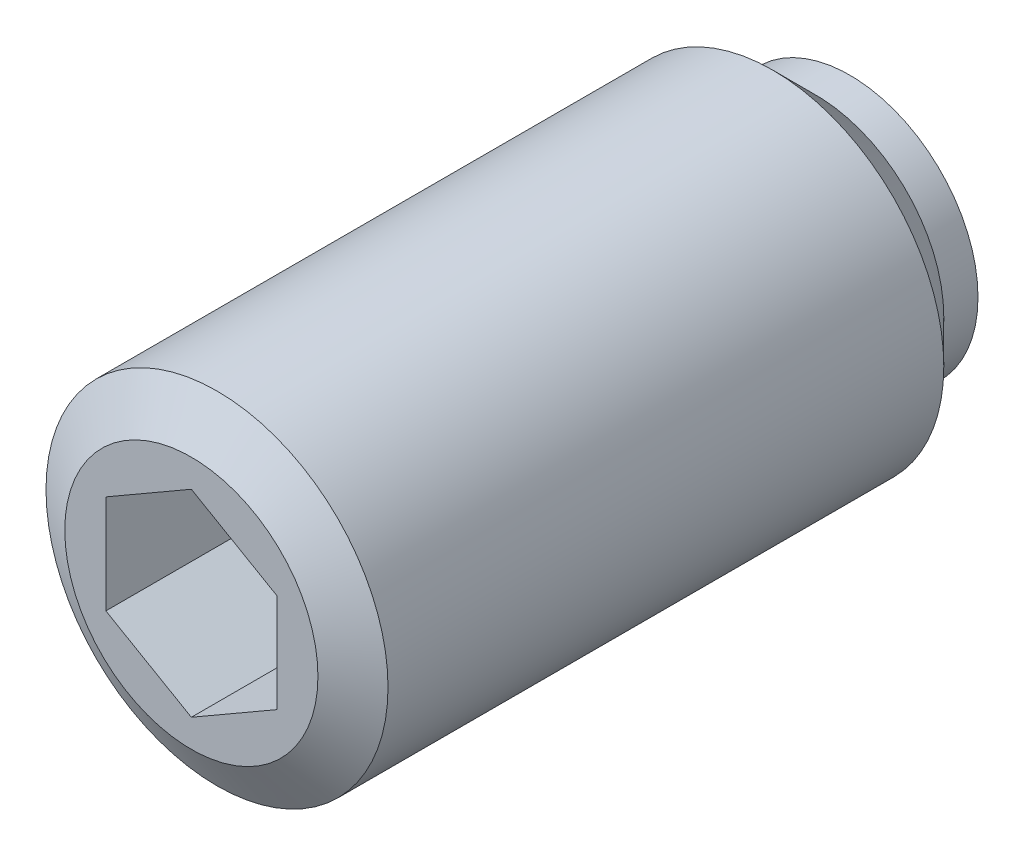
ISO-10303-21;
HEADER;
FILE_DESCRIPTION(('STEP AP214'),'2;1');
FILE_NAME('part.step','',(''),(''),'','','');
FILE_SCHEMA(('AUTOMOTIVE_DESIGN { 1 0 10303 214 1 1 1 1 }'));
ENDSEC;
DATA;
#1=APPLICATION_CONTEXT('core data for automotive mechanical design processes');
#2=APPLICATION_PROTOCOL_DEFINITION('international standard','automotive_design',2000,#1);
#3=PRODUCT_CONTEXT('',#1,'mechanical');
#4=PRODUCT('Part','Part','',(#3));
#5=PRODUCT_RELATED_PRODUCT_CATEGORY('part','',(#4));
#6=PRODUCT_DEFINITION_FORMATION('','',#4);
#7=PRODUCT_DEFINITION_CONTEXT('part definition',#1,'design');
#8=PRODUCT_DEFINITION('design','',#6,#7);
#9=PRODUCT_DEFINITION_SHAPE('','',#8);
#10=(LENGTH_UNIT() NAMED_UNIT(*) SI_UNIT(.MILLI.,.METRE.));
#11=(NAMED_UNIT(*) PLANE_ANGLE_UNIT() SI_UNIT($,.RADIAN.));
#12=(NAMED_UNIT(*) SI_UNIT($,.STERADIAN.) SOLID_ANGLE_UNIT());
#13=UNCERTAINTY_MEASURE_WITH_UNIT(LENGTH_MEASURE(1.E-05),#10,'distance_accuracy_value','');
#14=(GEOMETRIC_REPRESENTATION_CONTEXT(3) GLOBAL_UNCERTAINTY_ASSIGNED_CONTEXT((#13)) GLOBAL_UNIT_ASSIGNED_CONTEXT((#10,
#11,#12)) REPRESENTATION_CONTEXT('',''));
#15=CARTESIAN_POINT('',(0.,0.,0.));
#16=DIRECTION('',(0.,0.,1.));
#17=DIRECTION('',(1.,0.,0.));
#18=AXIS2_PLACEMENT_3D('',#15,#16,#17);
#19=CARTESIAN_POINT('',(0.,0.940733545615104,0.));
#20=DIRECTION('',(0.,0.,1.));
#21=DIRECTION('',(-1.,0.,0.));
#22=AXIS2_PLACEMENT_3D('',#19,#20,#21);
#23=PLANE('',#22);
#24=CARTESIAN_POINT('',(0.,0.,0.));
#25=DIRECTION('',(0.,0.,1.));
#26=DIRECTION('',(-1.,0.,0.));
#27=AXIS2_PLACEMENT_3D('',#24,#25,#26);
#28=CIRCLE('',#27,0.940733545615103);
#29=CARTESIAN_POINT('',(0.,0.940733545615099,0.));
#30=VERTEX_POINT('',#29);
#31=EDGE_CURVE('E9',#30,#30,#28,.T.);
#32=ORIENTED_EDGE('',*,*,#31,.F.);
#33=EDGE_LOOP('',(#32));
#34=FACE_BOUND('',#33,.T.);
#35=ADVANCED_FACE('F14',(#34),#23,.F.);
#36=CARTESIAN_POINT('',(0.,0.,0.823116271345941));
#37=DIRECTION('',(0.,0.,1.));
#38=DIRECTION('',(0.,1.,0.));
#39=AXIS2_PLACEMENT_3D('',#36,#37,#38);
#40=SPHERICAL_SURFACE('',#39,1.25);
#41=CARTESIAN_POINT('',(0.,0.,0.2));
#42=DIRECTION('',(0.,0.,1.));
#43=DIRECTION('',(-1.,0.,0.));
#44=AXIS2_PLACEMENT_3D('',#41,#42,#43);
#45=CIRCLE('',#44,1.0836171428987);
#46=CARTESIAN_POINT('',(0.,1.0836171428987,0.2));
#47=VERTEX_POINT('',#46);
#48=EDGE_CURVE('E21',#47,#47,#45,.T.);
#49=CARTESIAN_POINT('',(0.,1.0836171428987,0.2));
#50=CARTESIAN_POINT('',(0.,1.08233874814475,0.197776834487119));
#51=CARTESIAN_POINT('',(0.,1.08105351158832,0.1955576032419));
#52=CARTESIAN_POINT('',(0.,1.0784694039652,0.191127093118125));
#53=CARTESIAN_POINT('',(0.,1.0771705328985,0.188915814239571));
#54=CARTESIAN_POINT('',(0.,1.07455920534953,0.184501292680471));
#55=CARTESIAN_POINT('',(0.,1.07324674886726,0.182298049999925));
#56=CARTESIAN_POINT('',(0.,1.07060830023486,0.177899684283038));
#57=CARTESIAN_POINT('',(0.,1.06928230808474,0.175704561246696));
#58=CARTESIAN_POINT('',(0.,1.06661683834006,0.171322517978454));
#59=CARTESIAN_POINT('',(0.,1.0652773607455,0.169135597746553));
#60=CARTESIAN_POINT('',(0.,1.06258497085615,0.164770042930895));
#61=CARTESIAN_POINT('',(0.,1.06123205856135,0.162591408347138));
#62=CARTESIAN_POINT('',(0.,1.05851285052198,0.158242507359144));
#63=CARTESIAN_POINT('',(0.,1.05714655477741,0.156072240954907));
#64=CARTESIAN_POINT('',(0.,1.05440063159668,0.151740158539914));
#65=CARTESIAN_POINT('',(0.,1.05302100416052,0.149578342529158));
#66=CARTESIAN_POINT('',(0.,1.05024846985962,0.145263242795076));
#67=CARTESIAN_POINT('',(0.,1.04885556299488,0.143109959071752));
#68=CARTESIAN_POINT('',(0.,1.04605652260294,0.138812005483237));
#69=CARTESIAN_POINT('',(0.,1.04465038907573,0.136667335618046));
#70=CARTESIAN_POINT('',(0.,1.04182494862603,0.132386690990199));
#71=CARTESIAN_POINT('',(0.,1.04040564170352,0.130250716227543));
#72=CARTESIAN_POINT('',(0.,1.0375539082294,0.125987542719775));
#73=CARTESIAN_POINT('',(0.,1.03612148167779,0.123860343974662));
#74=CARTESIAN_POINT('',(0.,1.03324356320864,0.119614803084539));
#75=CARTESIAN_POINT('',(0.,1.03179807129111,0.117496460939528));
#76=CARTESIAN_POINT('',(0.,1.02889407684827,0.113268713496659));
#77=CARTESIAN_POINT('',(0.,1.02743557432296,0.1111593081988));
#78=CARTESIAN_POINT('',(0.,1.02450561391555,0.106949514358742));
#79=CARTESIAN_POINT('',(0.,1.02303415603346,0.104849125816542));
#80=CARTESIAN_POINT('',(0.,1.02007834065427,0.100657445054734));
#81=CARTESIAN_POINT('',(0.,1.01859398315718,0.0985661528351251));
#82=CARTESIAN_POINT('',(0.,1.01561242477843,0.094392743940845));
#83=CARTESIAN_POINT('',(0.,1.01411522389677,0.0923106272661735));
#84=CARTESIAN_POINT('',(0.,1.01110803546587,0.0881556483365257));
#85=CARTESIAN_POINT('',(0.,1.00959804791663,0.0860827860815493));
#86=CARTESIAN_POINT('',(0.,1.00656534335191,0.0819463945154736));
#87=CARTESIAN_POINT('',(0.,1.00504262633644,0.0798828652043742));
#88=CARTESIAN_POINT('',(0.,1.00198452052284,0.0757652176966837));
#89=CARTESIAN_POINT('',(0.,1.00044913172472,0.0737110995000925));
#90=CARTESIAN_POINT('',(0.,0.99736574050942,0.0696123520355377));
#91=CARTESIAN_POINT('',(0.,0.99581773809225,0.0675677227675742));
#92=CARTESIAN_POINT('',(0.,0.992709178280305,0.0634880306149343));
#93=CARTESIAN_POINT('',(0.,0.991148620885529,0.061452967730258));
#94=CARTESIAN_POINT('',(0.,0.988015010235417,0.0573924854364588));
#95=CARTESIAN_POINT('',(0.,0.986441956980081,0.055367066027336));
#96=CARTESIAN_POINT('',(0.,0.983283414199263,0.0513259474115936));
#97=CARTESIAN_POINT('',(0.,0.981697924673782,0.049310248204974));
#98=CARTESIAN_POINT('',(0.,0.978514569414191,0.0452886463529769));
#99=CARTESIAN_POINT('',(0.,0.976916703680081,0.0432827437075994));
#100=CARTESIAN_POINT('',(0.,0.973708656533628,0.0392808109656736));
#101=CARTESIAN_POINT('',(0.,0.972098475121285,0.0372847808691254));
#102=CARTESIAN_POINT('',(0.,0.968865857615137,0.0333026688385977));
#103=CARTESIAN_POINT('',(0.,0.967243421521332,0.0313165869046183));
#104=CARTESIAN_POINT('',(0.,0.963986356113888,0.0273544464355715));
#105=CARTESIAN_POINT('',(0.,0.962351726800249,0.0253783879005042));
#106=CARTESIAN_POINT('',(0.,0.959070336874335,0.0214363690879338));
#107=CARTESIAN_POINT('',(0.,0.957423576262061,0.0194704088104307));
#108=CARTESIAN_POINT('',(0.,0.954117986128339,0.0155486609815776));
#109=CARTESIAN_POINT('',(0.,0.952459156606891,0.0135928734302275));
#110=CARTESIAN_POINT('',(0.,0.949129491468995,0.00969154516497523));
#111=CARTESIAN_POINT('',(0.,0.947458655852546,0.00774600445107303));
#112=CARTESIAN_POINT('',(0.,0.944105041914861,0.00386524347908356));
#113=CARTESIAN_POINT('',(0.,0.942422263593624,0.00193002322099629));
#114=CARTESIAN_POINT('',(0.,0.940733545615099,0.));
#115=B_SPLINE_CURVE_WITH_KNOTS('',3,(#49,#50,#51,#52,#53,#54,#55,#56,#57,#58,#59,#60,#61,#62,
#63,#64,#65,#66,#67,#68,#69,#70,#71,#72,#73,#74,#75,#76,#77,#78,#79,#80,#81,#82,#83,#84,#85,#86,
#87,#88,#89,#90,#91,#92,#93,#94,#95,#96,#97,#98,#99,#100,#101,#102,#103,#104,#105,#106,#107,
#108,#109,#110,#111,#112,#113,#114),.UNSPECIFIED.,.F.,.F.,(4,2,2,2,2,2,2,2,2,2,2,2,2,2,2,2,2,2,
2,2,2,2,2,2,2,2,2,2,2,2,2,2,4),(0.,0.00769354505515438,0.0153870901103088,0.0230806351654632,
0.0307741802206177,0.0384677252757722,0.0461612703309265,0.0538548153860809,0.0615483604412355,
0.0692419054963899,0.0769354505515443,0.0846289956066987,0.092322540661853,0.100016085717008,
0.107709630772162,0.115403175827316,0.123096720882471,0.130790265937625,0.13848381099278,
0.146177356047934,0.153870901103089,0.161564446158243,0.169257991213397,0.176951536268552,
0.184645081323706,0.192338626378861,0.200032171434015,0.20772571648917,0.215419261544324,
0.223112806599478,0.230806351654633,0.238499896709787,0.246193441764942),.UNSPECIFIED.);
#116=EDGE_CURVE('BSEAM141',#47,#30,#115,.T.);
#117=ORIENTED_EDGE('',*,*,#48,.F.);
#118=ORIENTED_EDGE('',*,*,#31,.T.);
#119=ORIENTED_EDGE('',*,*,#116,.T.);
#120=ORIENTED_EDGE('',*,*,#116,.F.);
#121=EDGE_LOOP('',(#117,#119,#118,#120));
#122=FACE_BOUND('',#121,.T.);
#123=ADVANCED_FACE('F141',(#122),#40,.T.);
#124=CARTESIAN_POINT('',(0.,1.5,0.2));
#125=DIRECTION('',(0.,0.,1.));
#126=DIRECTION('',(-1.,0.,0.));
#127=AXIS2_PLACEMENT_3D('',#124,#125,#126);
#128=PLANE('',#127);
#129=CARTESIAN_POINT('',(0.,0.,0.2));
#130=DIRECTION('',(0.,0.,1.));
#131=DIRECTION('',(-1.,0.,0.));
#132=AXIS2_PLACEMENT_3D('',#129,#130,#131);
#133=CIRCLE('',#132,1.5);
#134=CARTESIAN_POINT('',(-1.5,0.,0.2));
#135=VERTEX_POINT('',#134);
#136=EDGE_CURVE('E134',#135,#135,#133,.T.);
#137=ORIENTED_EDGE('',*,*,#136,.F.);
#138=EDGE_LOOP('',(#137));
#139=FACE_BOUND('',#138,.T.);
#140=ORIENTED_EDGE('',*,*,#48,.T.);
#141=EDGE_LOOP('',(#140));
#142=FACE_BOUND('',#141,.T.);
#143=ADVANCED_FACE('F139',(#139,#142),#128,.F.);
#144=CARTESIAN_POINT('',(0.,0.,9.29507492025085));
#145=DIRECTION('',(0.,0.,1.));
#146=DIRECTION('',(-1.,0.,0.));
#147=AXIS2_PLACEMENT_3D('',#144,#145,#146);
#148=CYLINDRICAL_SURFACE('',#147,1.5);
#149=CARTESIAN_POINT('',(0.,0.,0.6));
#150=DIRECTION('',(0.,0.,1.));
#151=DIRECTION('',(-1.,0.,0.));
#152=AXIS2_PLACEMENT_3D('',#149,#150,#151);
#153=CIRCLE('',#152,1.5);
#154=CARTESIAN_POINT('',(-1.5,0.,0.6));
#155=VERTEX_POINT('',#154);
#156=EDGE_CURVE('E131',#155,#155,#153,.T.);
#157=ORIENTED_EDGE('',*,*,#156,.F.);
#158=EDGE_LOOP('',(#157));
#159=FACE_BOUND('',#158,.T.);
#160=ORIENTED_EDGE('',*,*,#136,.T.);
#161=EDGE_LOOP('',(#160));
#162=FACE_BOUND('',#161,.T.);
#163=ADVANCED_FACE('F164',(#159,#162),#148,.T.);
#164=CARTESIAN_POINT('',(0.,0.,0.6));
#165=DIRECTION('',(0.,0.,1.));
#166=DIRECTION('',(-1.,0.,0.));
#167=AXIS2_PLACEMENT_3D('',#164,#165,#166);
#168=CONICAL_SURFACE('',#167,1.5,0.785398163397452);
#169=CARTESIAN_POINT('',(0.,0.,1.1));
#170=DIRECTION('',(0.,0.,1.));
#171=DIRECTION('',(-1.,0.,0.));
#172=AXIS2_PLACEMENT_3D('',#169,#170,#171);
#173=CIRCLE('',#172,2.);
#174=CARTESIAN_POINT('',(-2.,0.,1.1));
#175=VERTEX_POINT('',#174);
#176=EDGE_CURVE('E128',#175,#175,#173,.T.);
#177=ORIENTED_EDGE('',*,*,#176,.F.);
#178=EDGE_LOOP('',(#177));
#179=FACE_BOUND('',#178,.T.);
#180=ORIENTED_EDGE('',*,*,#156,.T.);
#181=EDGE_LOOP('',(#180));
#182=FACE_BOUND('',#181,.T.);
#183=ADVANCED_FACE('F173',(#179,#182),#168,.T.);
#184=CARTESIAN_POINT('',(0.,0.,9.29507492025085));
#185=DIRECTION('',(0.,0.,1.));
#186=DIRECTION('',(-1.,0.,0.));
#187=AXIS2_PLACEMENT_3D('',#184,#185,#186);
#188=CYLINDRICAL_SURFACE('',#187,2.);
#189=CARTESIAN_POINT('',(0.,0.,7.6));
#190=DIRECTION('',(0.,0.,1.));
#191=DIRECTION('',(-1.,0.,0.));
#192=AXIS2_PLACEMENT_3D('',#189,#190,#191);
#193=CIRCLE('',#192,2.);
#194=CARTESIAN_POINT('',(-2.,0.,7.6));
#195=VERTEX_POINT('',#194);
#196=EDGE_CURVE('E125',#195,#195,#193,.T.);
#197=ORIENTED_EDGE('',*,*,#196,.F.);
#198=EDGE_LOOP('',(#197));
#199=FACE_BOUND('',#198,.T.);
#200=ORIENTED_EDGE('',*,*,#176,.T.);
#201=EDGE_LOOP('',(#200));
#202=FACE_BOUND('',#201,.T.);
#203=ADVANCED_FACE('F182',(#199,#202),#188,.T.);
#204=CARTESIAN_POINT('',(0.,0.,7.6));
#205=DIRECTION('',(0.,0.,-1.));
#206=DIRECTION('',(1.,0.,0.));
#207=AXIS2_PLACEMENT_3D('',#204,#205,#206);
#208=CONICAL_SURFACE('',#207,2.,1.04719755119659);
#209=CARTESIAN_POINT('',(0.,0.,7.9));
#210=DIRECTION('',(0.,0.,1.));
#211=DIRECTION('',(-1.,0.,0.));
#212=AXIS2_PLACEMENT_3D('',#209,#210,#211);
#213=CIRCLE('',#212,1.48038475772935);
#214=CARTESIAN_POINT('',(-1.48038475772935,0.,7.9));
#215=VERTEX_POINT('',#214);
#216=EDGE_CURVE('E116',#215,#215,#213,.T.);
#217=ORIENTED_EDGE('',*,*,#216,.F.);
#218=EDGE_LOOP('',(#217));
#219=FACE_BOUND('',#218,.T.);
#220=ORIENTED_EDGE('',*,*,#196,.T.);
#221=EDGE_LOOP('',(#220));
#222=FACE_BOUND('',#221,.T.);
#223=ADVANCED_FACE('F191',(#219,#222),#208,.T.);
#224=CARTESIAN_POINT('',(0.,0.,7.9));
#225=DIRECTION('',(0.,0.,-1.));
#226=DIRECTION('',(1.,0.,0.));
#227=AXIS2_PLACEMENT_3D('',#224,#225,#226);
#228=PLANE('',#227);
#229=DIRECTION('',(-0.866025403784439,-0.5,0.));
#230=VECTOR('',#229,1.);
#231=CARTESIAN_POINT('',(0.,1.15470053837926,7.9));
#232=LINE('',#231,#230);
#233=CARTESIAN_POINT('',(0.,1.15470053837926,7.9));
#234=VERTEX_POINT('',#233);
#235=CARTESIAN_POINT('',(-1.,0.577350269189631,7.9));
#236=VERTEX_POINT('',#235);
#237=EDGE_CURVE('E82',#234,#236,#232,.T.);
#238=ORIENTED_EDGE('',*,*,#237,.F.);
#239=DIRECTION('',(-0.866025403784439,0.5,0.));
#240=VECTOR('',#239,1.);
#241=CARTESIAN_POINT('',(1.,0.577350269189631,7.9));
#242=LINE('',#241,#240);
#243=CARTESIAN_POINT('',(1.,0.577350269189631,7.9));
#244=VERTEX_POINT('',#243);
#245=EDGE_CURVE('E28',#244,#234,#242,.T.);
#246=ORIENTED_EDGE('',*,*,#245,.F.);
#247=DIRECTION('',(0.,1.,0.));
#248=VECTOR('',#247,1.);
#249=CARTESIAN_POINT('',(1.,-0.577350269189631,7.9));
#250=LINE('',#249,#248);
#251=CARTESIAN_POINT('',(1.,-0.577350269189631,7.9));
#252=VERTEX_POINT('',#251);
#253=EDGE_CURVE('E98',#252,#244,#250,.T.);
#254=ORIENTED_EDGE('',*,*,#253,.F.);
#255=DIRECTION('',(0.866025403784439,0.5,0.));
#256=VECTOR('',#255,1.);
#257=CARTESIAN_POINT('',(0.,-1.15470053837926,7.9));
#258=LINE('',#257,#256);
#259=CARTESIAN_POINT('',(0.,-1.15470053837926,7.9));
#260=VERTEX_POINT('',#259);
#261=EDGE_CURVE('E92',#260,#252,#258,.T.);
#262=ORIENTED_EDGE('',*,*,#261,.F.);
#263=DIRECTION('',(0.866025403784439,-0.5,0.));
#264=VECTOR('',#263,1.);
#265=CARTESIAN_POINT('',(-1.,-0.577350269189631,7.9));
#266=LINE('',#265,#264);
#267=CARTESIAN_POINT('',(-1.,-0.577350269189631,7.9));
#268=VERTEX_POINT('',#267);
#269=EDGE_CURVE('E90',#268,#260,#266,.T.);
#270=ORIENTED_EDGE('',*,*,#269,.F.);
#271=DIRECTION('',(0.,-1.,0.));
#272=VECTOR('',#271,1.);
#273=CARTESIAN_POINT('',(-1.,0.577350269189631,7.9));
#274=LINE('',#273,#272);
#275=EDGE_CURVE('E71',#236,#268,#274,.T.);
#276=ORIENTED_EDGE('',*,*,#275,.F.);
#277=EDGE_LOOP('',(#238,#246,#254,#262,#270,#276));
#278=FACE_BOUND('',#277,.T.);
#279=ORIENTED_EDGE('',*,*,#216,.T.);
#280=EDGE_LOOP('',(#279));
#281=FACE_BOUND('',#280,.T.);
#282=ADVANCED_FACE('F86',(#278,#281),#228,.F.);
#283=CARTESIAN_POINT('',(1.,0.577350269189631,5.9));
#284=DIRECTION('',(0.5,0.866025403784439,0.));
#285=DIRECTION('',(0.866025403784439,-0.5,0.));
#286=AXIS2_PLACEMENT_3D('',#283,#284,#285);
#287=PLANE('',#286);
#288=ORIENTED_EDGE('',*,*,#245,.T.);
#289=DIRECTION('',(0.,0.,1.));
#290=VECTOR('',#289,1.);
#291=CARTESIAN_POINT('',(0.,1.15470053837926,5.9));
#292=LINE('',#291,#290);
#293=CARTESIAN_POINT('',(0.,1.15470053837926,5.9));
#294=VERTEX_POINT('',#293);
#295=EDGE_CURVE('E79',#294,#234,#292,.T.);
#296=ORIENTED_EDGE('',*,*,#295,.F.);
#297=DIRECTION('',(-0.866025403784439,0.5,0.));
#298=VECTOR('',#297,1.);
#299=CARTESIAN_POINT('',(1.,0.577350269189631,5.9));
#300=LINE('',#299,#298);
#301=CARTESIAN_POINT('',(1.,0.577350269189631,5.9));
#302=VERTEX_POINT('',#301);
#303=EDGE_CURVE('E100',#302,#294,#300,.T.);
#304=ORIENTED_EDGE('',*,*,#303,.F.);
#305=DIRECTION('',(0.,0.,1.));
#306=VECTOR('',#305,1.);
#307=CARTESIAN_POINT('',(1.,0.577350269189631,5.9));
#308=LINE('',#307,#306);
#309=EDGE_CURVE('E35',#302,#244,#308,.T.);
#310=ORIENTED_EDGE('',*,*,#309,.T.);
#311=EDGE_LOOP('',(#288,#296,#304,#310));
#312=FACE_BOUND('',#311,.T.);
#313=ADVANCED_FACE('F208',(#312),#287,.F.);
#314=CARTESIAN_POINT('',(1.,-0.577350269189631,5.9));
#315=DIRECTION('',(1.,0.,0.));
#316=DIRECTION('',(0.,-1.,0.));
#317=AXIS2_PLACEMENT_3D('',#314,#315,#316);
#318=PLANE('',#317);
#319=ORIENTED_EDGE('',*,*,#253,.T.);
#320=ORIENTED_EDGE('',*,*,#309,.F.);
#321=DIRECTION('',(0.,1.,0.));
#322=VECTOR('',#321,1.);
#323=CARTESIAN_POINT('',(1.,-0.577350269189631,5.9));
#324=LINE('',#323,#322);
#325=CARTESIAN_POINT('',(1.,-0.577350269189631,5.9));
#326=VERTEX_POINT('',#325);
#327=EDGE_CURVE('E112',#326,#302,#324,.T.);
#328=ORIENTED_EDGE('',*,*,#327,.F.);
#329=DIRECTION('',(0.,0.,1.));
#330=VECTOR('',#329,1.);
#331=CARTESIAN_POINT('',(1.,-0.577350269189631,5.9));
#332=LINE('',#331,#330);
#333=EDGE_CURVE('E117',#326,#252,#332,.T.);
#334=ORIENTED_EDGE('',*,*,#333,.T.);
#335=EDGE_LOOP('',(#319,#320,#328,#334));
#336=FACE_BOUND('',#335,.T.);
#337=ADVANCED_FACE('F216',(#336),#318,.F.);
#338=CARTESIAN_POINT('',(0.,-1.15470053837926,5.9));
#339=DIRECTION('',(0.5,-0.866025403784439,0.));
#340=DIRECTION('',(-0.866025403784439,-0.5,0.));
#341=AXIS2_PLACEMENT_3D('',#338,#339,#340);
#342=PLANE('',#341);
#343=ORIENTED_EDGE('',*,*,#261,.T.);
#344=ORIENTED_EDGE('',*,*,#333,.F.);
#345=DIRECTION('',(0.866025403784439,0.5,0.));
#346=VECTOR('',#345,1.);
#347=CARTESIAN_POINT('',(0.,-1.15470053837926,5.9));
#348=LINE('',#347,#346);
#349=CARTESIAN_POINT('',(0.,-1.15470053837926,5.9));
#350=VERTEX_POINT('',#349);
#351=EDGE_CURVE('E109',#350,#326,#348,.T.);
#352=ORIENTED_EDGE('',*,*,#351,.F.);
#353=DIRECTION('',(0.,0.,1.));
#354=VECTOR('',#353,1.);
#355=CARTESIAN_POINT('',(0.,-1.15470053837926,5.9));
#356=LINE('',#355,#354);
#357=EDGE_CURVE('E119',#350,#260,#356,.T.);
#358=ORIENTED_EDGE('',*,*,#357,.T.);
#359=EDGE_LOOP('',(#343,#344,#352,#358));
#360=FACE_BOUND('',#359,.T.);
#361=ADVANCED_FACE('F224',(#360),#342,.F.);
#362=CARTESIAN_POINT('',(-1.,-0.577350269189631,5.9));
#363=DIRECTION('',(-0.5,-0.866025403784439,0.));
#364=DIRECTION('',(-0.866025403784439,0.5,0.));
#365=AXIS2_PLACEMENT_3D('',#362,#363,#364);
#366=PLANE('',#365);
#367=ORIENTED_EDGE('',*,*,#269,.T.);
#368=ORIENTED_EDGE('',*,*,#357,.F.);
#369=DIRECTION('',(0.866025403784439,-0.5,0.));
#370=VECTOR('',#369,1.);
#371=CARTESIAN_POINT('',(-1.,-0.577350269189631,5.9));
#372=LINE('',#371,#370);
#373=CARTESIAN_POINT('',(-1.,-0.577350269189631,5.9));
#374=VERTEX_POINT('',#373);
#375=EDGE_CURVE('E106',#374,#350,#372,.T.);
#376=ORIENTED_EDGE('',*,*,#375,.F.);
#377=DIRECTION('',(0.,0.,1.));
#378=VECTOR('',#377,1.);
#379=CARTESIAN_POINT('',(-1.,-0.577350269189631,5.9));
#380=LINE('',#379,#378);
#381=EDGE_CURVE('E78',#374,#268,#380,.T.);
#382=ORIENTED_EDGE('',*,*,#381,.T.);
#383=EDGE_LOOP('',(#367,#368,#376,#382));
#384=FACE_BOUND('',#383,.T.);
#385=ADVANCED_FACE('F232',(#384),#366,.F.);
#386=CARTESIAN_POINT('',(-1.,0.577350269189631,5.9));
#387=DIRECTION('',(-1.,0.,0.));
#388=DIRECTION('',(0.,0.,-1.));
#389=AXIS2_PLACEMENT_3D('',#386,#387,#388);
#390=PLANE('',#389);
#391=ORIENTED_EDGE('',*,*,#275,.T.);
#392=ORIENTED_EDGE('',*,*,#381,.F.);
#393=DIRECTION('',(0.,-1.,0.));
#394=VECTOR('',#393,1.);
#395=CARTESIAN_POINT('',(-1.,0.577350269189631,5.9));
#396=LINE('',#395,#394);
#397=CARTESIAN_POINT('',(-1.,0.577350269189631,5.9));
#398=VERTEX_POINT('',#397);
#399=EDGE_CURVE('E74',#398,#374,#396,.T.);
#400=ORIENTED_EDGE('',*,*,#399,.F.);
#401=DIRECTION('',(0.,0.,1.));
#402=VECTOR('',#401,1.);
#403=CARTESIAN_POINT('',(-1.,0.577350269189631,5.9));
#404=LINE('',#403,#402);
#405=EDGE_CURVE('E67',#398,#236,#404,.T.);
#406=ORIENTED_EDGE('',*,*,#405,.T.);
#407=EDGE_LOOP('',(#391,#392,#400,#406));
#408=FACE_BOUND('',#407,.T.);
#409=ADVANCED_FACE('F69',(#408),#390,.F.);
#410=CARTESIAN_POINT('',(0.,1.15470053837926,5.9));
#411=DIRECTION('',(-0.5,0.866025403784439,0.));
#412=DIRECTION('',(0.866025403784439,0.5,0.));
#413=AXIS2_PLACEMENT_3D('',#410,#411,#412);
#414=PLANE('',#413);
#415=ORIENTED_EDGE('',*,*,#237,.T.);
#416=ORIENTED_EDGE('',*,*,#405,.F.);
#417=DIRECTION('',(-0.866025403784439,-0.5,0.));
#418=VECTOR('',#417,1.);
#419=CARTESIAN_POINT('',(0.,1.15470053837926,5.9));
#420=LINE('',#419,#418);
#421=EDGE_CURVE('E103',#294,#398,#420,.T.);
#422=ORIENTED_EDGE('',*,*,#421,.F.);
#423=ORIENTED_EDGE('',*,*,#295,.T.);
#424=EDGE_LOOP('',(#415,#416,#422,#423));
#425=FACE_BOUND('',#424,.T.);
#426=ADVANCED_FACE('F83',(#425),#414,.F.);
#427=CARTESIAN_POINT('',(2.,0.,5.9));
#428=DIRECTION('',(0.,0.,-1.));
#429=DIRECTION('',(1.,0.,0.));
#430=AXIS2_PLACEMENT_3D('',#427,#428,#429);
#431=PLANE('',#430);
#432=ORIENTED_EDGE('',*,*,#303,.T.);
#433=ORIENTED_EDGE('',*,*,#421,.T.);
#434=ORIENTED_EDGE('',*,*,#399,.T.);
#435=ORIENTED_EDGE('',*,*,#375,.T.);
#436=ORIENTED_EDGE('',*,*,#351,.T.);
#437=ORIENTED_EDGE('',*,*,#327,.T.);
#438=EDGE_LOOP('',(#432,#433,#434,#435,#436,#437));
#439=FACE_BOUND('',#438,.T.);
#440=ADVANCED_FACE('F256',(#439),#431,.F.);
#441=CLOSED_SHELL('',(#35,#123,#143,#163,#183,#203,#223,#282,#313,#337,#361,#385,#409,#426,#440));
#442=MANIFOLD_SOLID_BREP('B1',#441);
#443=ADVANCED_BREP_SHAPE_REPRESENTATION('',(#18,#442),#14);
#444=SHAPE_DEFINITION_REPRESENTATION(#9,#443);
ENDSEC;
END-ISO-10303-21;
